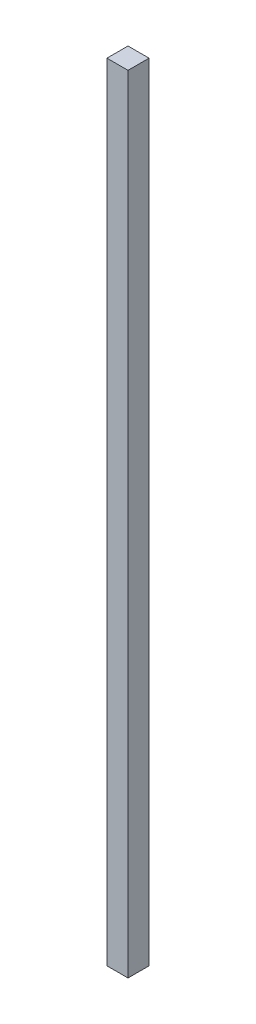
from build123d import *

# Parameters (mm, degrees)
SKETCH_1_W      = 60
SKETCH_1_H      = 60
EXTRUDE_1_DEPTH = 2240


with BuildPart() as part:
    # Sketch 1 → Extrude 1 (new body)
    with BuildSketch(Plane(origin=(0, 0, 0), x_dir=(1, 0, 0), z_dir=(0, 1, 0))):
        Rectangle(SKETCH_1_W, SKETCH_1_H)
    extrude(amount=EXTRUDE_1_DEPTH)


solid = part.part
